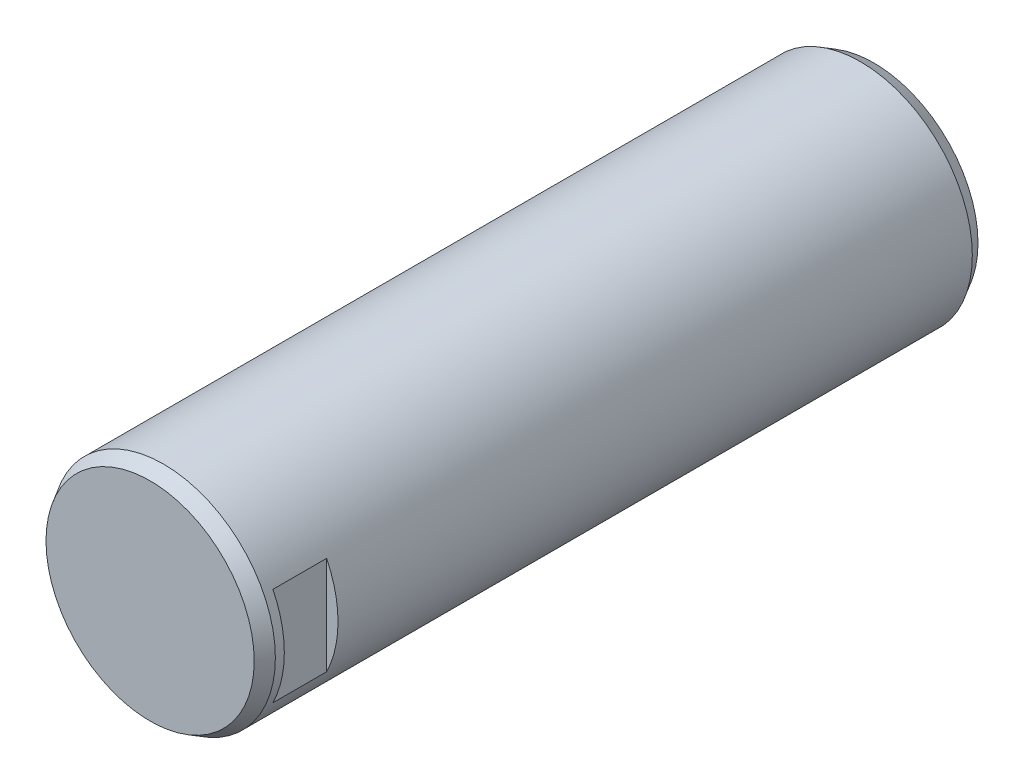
ISO-10303-21;
HEADER;
FILE_DESCRIPTION(('STEP AP214'),'2;1');
FILE_NAME('part.step','',(''),(''),'','','');
FILE_SCHEMA(('AUTOMOTIVE_DESIGN { 1 0 10303 214 1 1 1 1 }'));
ENDSEC;
DATA;
#1=APPLICATION_CONTEXT('core data for automotive mechanical design processes');
#2=APPLICATION_PROTOCOL_DEFINITION('international standard','automotive_design',2000,#1);
#3=PRODUCT_CONTEXT('',#1,'mechanical');
#4=PRODUCT('Part','Part','',(#3));
#5=PRODUCT_RELATED_PRODUCT_CATEGORY('part','',(#4));
#6=PRODUCT_DEFINITION_FORMATION('','',#4);
#7=PRODUCT_DEFINITION_CONTEXT('part definition',#1,'design');
#8=PRODUCT_DEFINITION('design','',#6,#7);
#9=PRODUCT_DEFINITION_SHAPE('','',#8);
#10=(LENGTH_UNIT() NAMED_UNIT(*) SI_UNIT(.MILLI.,.METRE.));
#11=(NAMED_UNIT(*) PLANE_ANGLE_UNIT() SI_UNIT($,.RADIAN.));
#12=(NAMED_UNIT(*) SI_UNIT($,.STERADIAN.) SOLID_ANGLE_UNIT());
#13=UNCERTAINTY_MEASURE_WITH_UNIT(LENGTH_MEASURE(1.E-05),#10,'distance_accuracy_value','');
#14=(GEOMETRIC_REPRESENTATION_CONTEXT(3) GLOBAL_UNCERTAINTY_ASSIGNED_CONTEXT((#13)) GLOBAL_UNIT_ASSIGNED_CONTEXT((#10,
#11,#12)) REPRESENTATION_CONTEXT('',''));
#15=CARTESIAN_POINT('',(0.,0.,0.));
#16=DIRECTION('',(0.,0.,1.));
#17=DIRECTION('',(1.,0.,0.));
#18=AXIS2_PLACEMENT_3D('',#15,#16,#17);
#19=CARTESIAN_POINT('',(0.,0.,80.89));
#20=DIRECTION('',(0.,0.,-1.));
#21=DIRECTION('',(-1.,0.,0.));
#22=AXIS2_PLACEMENT_3D('',#19,#20,#21);
#23=CYLINDRICAL_SURFACE('',#22,25.);
#24=CARTESIAN_POINT('',(0.,0.,75.89));
#25=DIRECTION('',(0.,0.,1.));
#26=DIRECTION('',(1.,0.,0.));
#27=AXIS2_PLACEMENT_3D('',#24,#25,#26);
#28=CIRCLE('',#27,25.);
#29=CARTESIAN_POINT('',(22.46,-10.9794535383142,75.89));
#30=VERTEX_POINT('',#29);
#31=CARTESIAN_POINT('',(22.46,10.9794535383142,75.89));
#32=VERTEX_POINT('',#31);
#33=EDGE_CURVE('E69',#30,#32,#28,.T.);
#34=ORIENTED_EDGE('',*,*,#33,.T.);
#35=DIRECTION('',(0.,0.,-1.));
#36=VECTOR('',#35,1.);
#37=CARTESIAN_POINT('',(22.46,10.9794535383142,80.89));
#38=LINE('',#37,#36);
#39=CARTESIAN_POINT('',(22.46,10.9794535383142,63.89));
#40=VERTEX_POINT('',#39);
#41=EDGE_CURVE('E11',#40,#32,#38,.F.);
#42=ORIENTED_EDGE('',*,*,#41,.F.);
#43=CARTESIAN_POINT('',(0.,0.,63.89));
#44=DIRECTION('',(0.,0.,-1.));
#45=DIRECTION('',(-1.,0.,0.));
#46=AXIS2_PLACEMENT_3D('',#43,#44,#45);
#47=CIRCLE('',#46,25.);
#48=CARTESIAN_POINT('',(22.46,-10.9794535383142,63.89));
#49=VERTEX_POINT('',#48);
#50=EDGE_CURVE('E55',#40,#49,#47,.T.);
#51=ORIENTED_EDGE('',*,*,#50,.T.);
#52=DIRECTION('',(0.,0.,-1.));
#53=VECTOR('',#52,1.);
#54=CARTESIAN_POINT('',(22.46,-10.9794535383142,80.89));
#55=LINE('',#54,#53);
#56=EDGE_CURVE('E47',#30,#49,#55,.T.);
#57=ORIENTED_EDGE('',*,*,#56,.F.);
#58=EDGE_LOOP('',(#34,#42,#51,#57));
#59=FACE_BOUND('',#58,.T.);
#60=CARTESIAN_POINT('',(0.,0.,77.8900000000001));
#61=DIRECTION('',(0.,0.,1.));
#62=DIRECTION('',(1.,0.,0.));
#63=AXIS2_PLACEMENT_3D('',#60,#61,#62);
#64=CIRCLE('',#63,25.);
#65=CARTESIAN_POINT('',(25.,0.,77.8900000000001));
#66=VERTEX_POINT('',#65);
#67=EDGE_CURVE('E86',#66,#66,#64,.F.);
#68=ORIENTED_EDGE('',*,*,#67,.T.);
#69=EDGE_LOOP('',(#68));
#70=FACE_BOUND('',#69,.T.);
#71=CARTESIAN_POINT('',(0.,0.,-77.8900000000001));
#72=DIRECTION('',(0.,0.,1.));
#73=DIRECTION('',(1.,0.,0.));
#74=AXIS2_PLACEMENT_3D('',#71,#72,#73);
#75=CIRCLE('',#74,25.);
#76=CARTESIAN_POINT('',(25.,0.,-77.8900000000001));
#77=VERTEX_POINT('',#76);
#78=EDGE_CURVE('E90',#77,#77,#75,.T.);
#79=ORIENTED_EDGE('',*,*,#78,.T.);
#80=EDGE_LOOP('',(#79));
#81=FACE_BOUND('',#80,.T.);
#82=ADVANCED_FACE('F38',(#59,#70,#81),#23,.T.);
#83=CARTESIAN_POINT('',(0.,0.,80.89));
#84=DIRECTION('',(0.,0.,1.));
#85=DIRECTION('',(1.,0.,0.));
#86=AXIS2_PLACEMENT_3D('',#83,#84,#85);
#87=PLANE('',#86);
#88=CARTESIAN_POINT('',(0.,0.,80.89));
#89=DIRECTION('',(0.,0.,1.));
#90=DIRECTION('',(1.,0.,0.));
#91=AXIS2_PLACEMENT_3D('',#88,#89,#90);
#92=CIRCLE('',#91,23.2679491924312);
#93=CARTESIAN_POINT('',(23.2679491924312,0.,80.89));
#94=VERTEX_POINT('',#93);
#95=EDGE_CURVE('E80',#94,#94,#92,.T.);
#96=ORIENTED_EDGE('',*,*,#95,.T.);
#97=EDGE_LOOP('',(#96));
#98=FACE_BOUND('',#97,.T.);
#99=ADVANCED_FACE('F110',(#98),#87,.T.);
#100=CARTESIAN_POINT('',(0.,0.,-80.89));
#101=DIRECTION('',(0.,0.,1.));
#102=DIRECTION('',(1.,0.,0.));
#103=AXIS2_PLACEMENT_3D('',#100,#101,#102);
#104=PLANE('',#103);
#105=CARTESIAN_POINT('',(0.,0.,-80.89));
#106=DIRECTION('',(0.,0.,1.));
#107=DIRECTION('',(1.,0.,0.));
#108=AXIS2_PLACEMENT_3D('',#105,#106,#107);
#109=CIRCLE('',#108,23.2679491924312);
#110=CARTESIAN_POINT('',(23.2679491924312,0.,-80.89));
#111=VERTEX_POINT('',#110);
#112=EDGE_CURVE('E94',#111,#111,#109,.F.);
#113=ORIENTED_EDGE('',*,*,#112,.T.);
#114=EDGE_LOOP('',(#113));
#115=FACE_BOUND('',#114,.T.);
#116=ADVANCED_FACE('F102',(#115),#104,.F.);
#117=CARTESIAN_POINT('',(0.,0.,80.89));
#118=DIRECTION('',(0.,0.,-1.));
#119=DIRECTION('',(-1.,0.,0.));
#120=AXIS2_PLACEMENT_3D('',#117,#118,#119);
#121=CONICAL_SURFACE('',#120,23.2679491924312,0.523598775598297);
#122=ORIENTED_EDGE('',*,*,#67,.F.);
#123=EDGE_LOOP('',(#122));
#124=FACE_BOUND('',#123,.T.);
#125=ORIENTED_EDGE('',*,*,#95,.F.);
#126=EDGE_LOOP('',(#125));
#127=FACE_BOUND('',#126,.T.);
#128=ADVANCED_FACE('F106',(#124,#127),#121,.T.);
#129=CARTESIAN_POINT('',(0.,0.,-77.8900000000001));
#130=DIRECTION('',(0.,0.,1.));
#131=DIRECTION('',(1.,0.,0.));
#132=AXIS2_PLACEMENT_3D('',#129,#130,#131);
#133=CONICAL_SURFACE('',#132,25.,0.523598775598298);
#134=ORIENTED_EDGE('',*,*,#112,.F.);
#135=EDGE_LOOP('',(#134));
#136=FACE_BOUND('',#135,.T.);
#137=ORIENTED_EDGE('',*,*,#78,.F.);
#138=EDGE_LOOP('',(#137));
#139=FACE_BOUND('',#138,.T.);
#140=ADVANCED_FACE('F40',(#136,#139),#133,.T.);
#141=CARTESIAN_POINT('',(22.46,21.1607943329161,75.89));
#142=DIRECTION('',(0.,0.,1.));
#143=DIRECTION('',(1.,0.,0.));
#144=AXIS2_PLACEMENT_3D('',#141,#142,#143);
#145=PLANE('',#144);
#146=ORIENTED_EDGE('',*,*,#33,.F.);
#147=DIRECTION('',(0.,-1.,0.));
#148=VECTOR('',#147,1.);
#149=CARTESIAN_POINT('',(22.46,21.1607943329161,75.89));
#150=LINE('',#149,#148);
#151=EDGE_CURVE('E75',#32,#30,#150,.T.);
#152=ORIENTED_EDGE('',*,*,#151,.F.);
#153=EDGE_LOOP('',(#146,#152));
#154=FACE_BOUND('',#153,.T.);
#155=ADVANCED_FACE('F77',(#154),#145,.F.);
#156=CARTESIAN_POINT('',(22.46,21.1607943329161,63.89));
#157=DIRECTION('',(0.,0.,-1.));
#158=DIRECTION('',(-1.,0.,0.));
#159=AXIS2_PLACEMENT_3D('',#156,#157,#158);
#160=PLANE('',#159);
#161=DIRECTION('',(0.,1.,0.));
#162=VECTOR('',#161,1.);
#163=CARTESIAN_POINT('',(22.46,21.1607943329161,63.89));
#164=LINE('',#163,#162);
#165=EDGE_CURVE('E76',#49,#40,#164,.T.);
#166=ORIENTED_EDGE('',*,*,#165,.F.);
#167=ORIENTED_EDGE('',*,*,#50,.F.);
#168=EDGE_LOOP('',(#166,#167));
#169=FACE_BOUND('',#168,.T.);
#170=ADVANCED_FACE('F158',(#169),#160,.F.);
#171=CARTESIAN_POINT('',(22.46,0.,0.));
#172=DIRECTION('',(1.,0.,0.));
#173=DIRECTION('',(0.,0.,-1.));
#174=AXIS2_PLACEMENT_3D('',#171,#172,#173);
#175=PLANE('',#174);
#176=ORIENTED_EDGE('',*,*,#56,.T.);
#177=ORIENTED_EDGE('',*,*,#165,.T.);
#178=ORIENTED_EDGE('',*,*,#41,.T.);
#179=ORIENTED_EDGE('',*,*,#151,.T.);
#180=EDGE_LOOP('',(#176,#177,#178,#179));
#181=FACE_BOUND('',#180,.T.);
#182=ADVANCED_FACE('F74',(#181),#175,.T.);
#183=CLOSED_SHELL('',(#82,#99,#116,#128,#140,#155,#170,#182));
#184=MANIFOLD_SOLID_BREP('B2',#183);
#185=ADVANCED_BREP_SHAPE_REPRESENTATION('',(#18,#184),#14);
#186=SHAPE_DEFINITION_REPRESENTATION(#9,#185);
ENDSEC;
END-ISO-10303-21;
